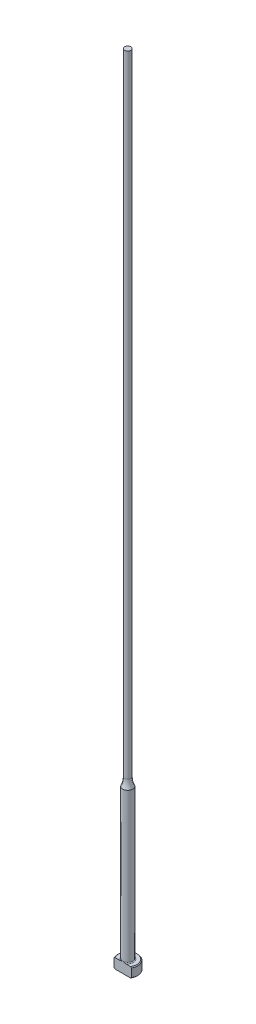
from build123d import *

# Parameters (mm, degrees)
CHAMFER1_SIZE      = 0.254
FILLET1_R          = 0.254
CUT_EXTRUDE1_DEPTH = 255.0396844


with BuildPart() as part:
    # Sketch1 → Revolve1 (revolve)
    with BuildSketch(Plane.XY, mode=Mode.PRIVATE) as revolve1_sk:
        with BuildLine():
            Line((0, 0), (-3.175, 0))
            Line((-3.175, 0), (-3.175, 3.175))
            Line((-3.175, 3.175), (-1.5875, 3.175))
            Line((-1.5875, 3.175), (-1.5875, 50.8))
            ThreePointArc((-1.5875, 50.8), (-1.142565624, 52.109911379), (-0.99187, 53.485093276))
            Line((-0.99187, 53.485093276), (-0.99187, 254))
            Line((-0.99187, 254), (0, 254))
            Line((0, 254), (0, 0))
        make_face()
    revolve(revolve1_sk.sketch.rotate(Axis((0, 259.958771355, 0), (0, -1, 0)), 270), axis=Axis((0, 259.958771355, 0), (0, -1, 0)))

    # Chamfer1
    chamfer1_edges = [part.edges().sort_by_distance(p)[0] for p in [
        (0, 0, -3.175),
        (0, 3.175, -3.175),
    ]]
    chamfer(chamfer1_edges, length=CHAMFER1_SIZE)

    # Fillet1
    fillet1_edges = [part.edges().sort_by_distance(p)[0] for p in [
        (0, 3.175, -1.5875),
    ]]
    fillet(fillet1_edges, radius=FILLET1_R)

    # Sketch2 → Cut-Extrude1 (cut, through all)
    with BuildSketch(Plane.XZ):
        with BuildLine():
            Line((-2.749630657, 1.5875), (2.749630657, 1.5875))
            ThreePointArc((2.749630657, 1.5875), (0, 3.175), (-2.749630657, 1.5875))
        make_face()
    extrude(amount=-CUT_EXTRUDE1_DEPTH, mode=Mode.SUBTRACT)


solid = part.part
